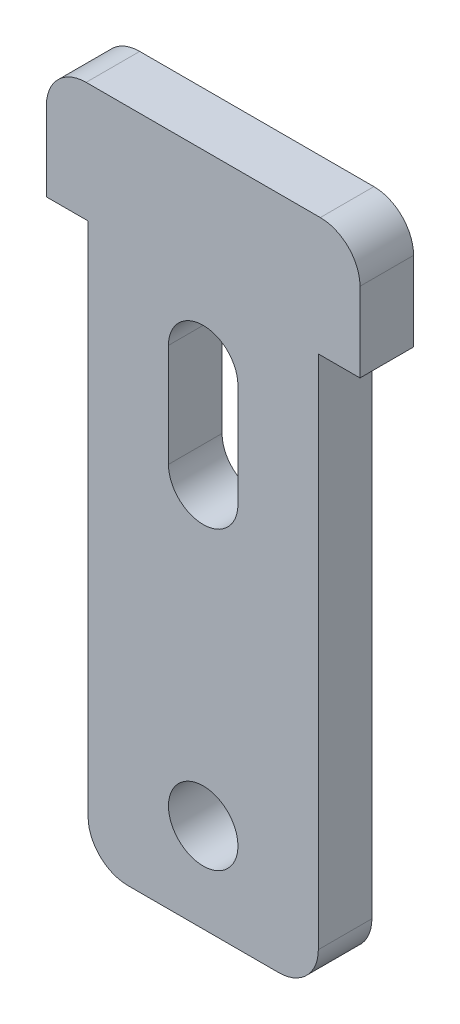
from build123d import *

# Parameters (mm, degrees)
ESQUISSE2_R        = 1.75
BOSS_EXTRU_1_DEPTH = 2.7


with BuildPart() as part:
    # Esquisse2 → Boss.-Extru.1 (new body)
    with BuildSketch(Plane.XY):
        with BuildLine():
            Line((-7.9, 0), (-5.8, 0))
            Line((-5.8, 0), (-5.8, -26))
            ThreePointArc((-5.8, -26), (-5.214213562, -27.414213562), (-3.8, -28))
            Line((-3.8, -28), (3.8, -28))
            ThreePointArc((3.8, -28), (5.214213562, -27.414213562), (5.8, -26))
            Line((5.8, -26), (5.8, 0))
            Line((5.8, 0), (7.9, 0))
            Line((7.9, 0), (7.9, 4))
            ThreePointArc((7.9, 4), (7.314213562, 5.414213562), (5.9, 6))
            Line((5.9, 6), (-5.9, 6))
            ThreePointArc((-5.9, 6), (-7.314213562, 5.414213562), (-7.9, 4))
            Line((-7.9, 4), (-7.9, 0))
        make_face()
        with Locations(Location((0, -23.5, 0), (0, 0, 180))):
            Circle(ESQUISSE2_R, mode=Mode.SUBTRACT)
        with BuildLine():
            Line((1.75, -3.402888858), (1.75, -8.597111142))
            ThreePointArc((1.75, -8.597111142), (0, -10.347111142), (-1.75, -8.597111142))
            Line((-1.75, -8.597111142), (-1.75, -3.402888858))
            ThreePointArc((-1.75, -3.402888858), (0, -1.652888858), (1.75, -3.402888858))
        make_face(mode=Mode.SUBTRACT)
    extrude(amount=BOSS_EXTRU_1_DEPTH)


solid = part.part
